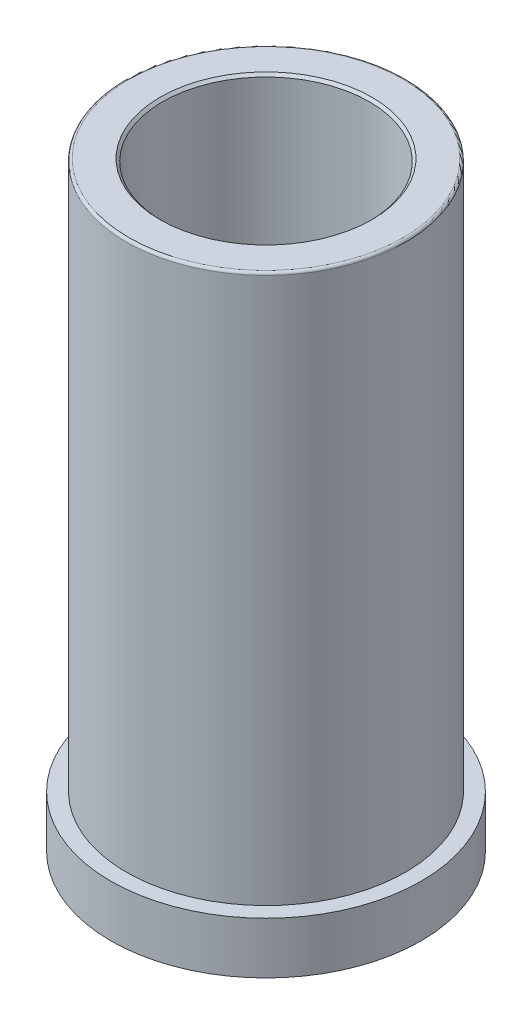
ISO-10303-21;
HEADER;
FILE_DESCRIPTION(('STEP AP214'),'2;1');
FILE_NAME('part.step','',(''),(''),'','','');
FILE_SCHEMA(('AUTOMOTIVE_DESIGN { 1 0 10303 214 1 1 1 1 }'));
ENDSEC;
DATA;
#1=APPLICATION_CONTEXT('core data for automotive mechanical design processes');
#2=APPLICATION_PROTOCOL_DEFINITION('international standard','automotive_design',2000,#1);
#3=PRODUCT_CONTEXT('',#1,'mechanical');
#4=PRODUCT('Part','Part','',(#3));
#5=PRODUCT_RELATED_PRODUCT_CATEGORY('part','',(#4));
#6=PRODUCT_DEFINITION_FORMATION('','',#4);
#7=PRODUCT_DEFINITION_CONTEXT('part definition',#1,'design');
#8=PRODUCT_DEFINITION('design','',#6,#7);
#9=PRODUCT_DEFINITION_SHAPE('','',#8);
#10=(LENGTH_UNIT() NAMED_UNIT(*) SI_UNIT(.MILLI.,.METRE.));
#11=(NAMED_UNIT(*) PLANE_ANGLE_UNIT() SI_UNIT($,.RADIAN.));
#12=(NAMED_UNIT(*) SI_UNIT($,.STERADIAN.) SOLID_ANGLE_UNIT());
#13=UNCERTAINTY_MEASURE_WITH_UNIT(LENGTH_MEASURE(1.E-05),#10,'distance_accuracy_value','');
#14=(GEOMETRIC_REPRESENTATION_CONTEXT(3) GLOBAL_UNCERTAINTY_ASSIGNED_CONTEXT((#13)) GLOBAL_UNIT_ASSIGNED_CONTEXT((#10,
#11,#12)) REPRESENTATION_CONTEXT('',''));
#15=CARTESIAN_POINT('',(0.,0.,0.));
#16=DIRECTION('',(0.,0.,1.));
#17=DIRECTION('',(1.,0.,0.));
#18=AXIS2_PLACEMENT_3D('',#15,#16,#17);
#19=CARTESIAN_POINT('',(0.,0.,0.));
#20=DIRECTION('',(0.,-1.,0.));
#21=DIRECTION('',(0.,0.,-1.));
#22=AXIS2_PLACEMENT_3D('',#19,#20,#21);
#23=CYLINDRICAL_SURFACE('',#22,27.);
#24=CARTESIAN_POINT('',(0.,105.5,0.));
#25=DIRECTION('',(0.,-1.,0.));
#26=DIRECTION('',(0.,0.,-1.));
#27=AXIS2_PLACEMENT_3D('',#24,#25,#26);
#28=CIRCLE('',#27,27.);
#29=CARTESIAN_POINT('',(0.,105.5,-27.));
#30=VERTEX_POINT('',#29);
#31=EDGE_CURVE('E21',#30,#30,#28,.T.);
#32=ORIENTED_EDGE('',*,*,#31,.T.);
#33=EDGE_LOOP('',(#32));
#34=FACE_BOUND('',#33,.T.);
#35=CARTESIAN_POINT('',(0.,0.,0.));
#36=DIRECTION('',(0.,-1.,0.));
#37=DIRECTION('',(0.,0.,-1.));
#38=AXIS2_PLACEMENT_3D('',#35,#36,#37);
#39=CIRCLE('',#38,27.);
#40=CARTESIAN_POINT('',(0.,0.,-27.));
#41=VERTEX_POINT('',#40);
#42=EDGE_CURVE('E49',#41,#41,#39,.T.);
#43=ORIENTED_EDGE('',*,*,#42,.F.);
#44=EDGE_LOOP('',(#43));
#45=FACE_BOUND('',#44,.T.);
#46=ADVANCED_FACE('F14',(#34,#45),#23,.T.);
#47=CARTESIAN_POINT('',(-27.,106.,0.));
#48=DIRECTION('',(0.,-1.,0.));
#49=DIRECTION('',(0.,0.,-1.));
#50=AXIS2_PLACEMENT_3D('',#47,#48,#49);
#51=PLANE('',#50);
#52=CARTESIAN_POINT('',(0.,106.,0.));
#53=DIRECTION('',(0.,-1.,0.));
#54=DIRECTION('',(0.,0.,-1.));
#55=AXIS2_PLACEMENT_3D('',#52,#53,#54);
#56=CIRCLE('',#55,26.5);
#57=CARTESIAN_POINT('',(0.,106.,-26.5));
#58=VERTEX_POINT('',#57);
#59=EDGE_CURVE('E9',#58,#58,#56,.F.);
#60=ORIENTED_EDGE('',*,*,#59,.T.);
#61=EDGE_LOOP('',(#60));
#62=FACE_BOUND('',#61,.T.);
#63=CARTESIAN_POINT('',(0.,106.,0.));
#64=DIRECTION('',(0.,-1.,0.));
#65=DIRECTION('',(0.,0.,-1.));
#66=AXIS2_PLACEMENT_3D('',#63,#64,#65);
#67=CIRCLE('',#66,20.5);
#68=CARTESIAN_POINT('',(0.,106.,-20.5));
#69=VERTEX_POINT('',#68);
#70=EDGE_CURVE('E37',#69,#69,#67,.T.);
#71=ORIENTED_EDGE('',*,*,#70,.T.);
#72=EDGE_LOOP('',(#71));
#73=FACE_BOUND('',#72,.T.);
#74=ADVANCED_FACE('F56',(#62,#73),#51,.F.);
#75=CARTESIAN_POINT('',(0.,0.,0.));
#76=DIRECTION('',(0.,-1.,0.));
#77=DIRECTION('',(0.,0.,-1.));
#78=AXIS2_PLACEMENT_3D('',#75,#76,#77);
#79=CYLINDRICAL_SURFACE('',#78,20.);
#80=CARTESIAN_POINT('',(0.,105.5,0.));
#81=DIRECTION('',(0.,-1.,0.));
#82=DIRECTION('',(0.,0.,-1.));
#83=AXIS2_PLACEMENT_3D('',#80,#81,#82);
#84=CIRCLE('',#83,20.);
#85=CARTESIAN_POINT('',(0.,105.5,-20.));
#86=VERTEX_POINT('',#85);
#87=EDGE_CURVE('E34',#86,#86,#84,.F.);
#88=ORIENTED_EDGE('',*,*,#87,.T.);
#89=EDGE_LOOP('',(#88));
#90=FACE_BOUND('',#89,.T.);
#91=CARTESIAN_POINT('',(0.,-10.,0.));
#92=DIRECTION('',(0.,-1.,0.));
#93=DIRECTION('',(0.,0.,-1.));
#94=AXIS2_PLACEMENT_3D('',#91,#92,#93);
#95=CIRCLE('',#94,20.);
#96=CARTESIAN_POINT('',(0.,-10.,-20.));
#97=VERTEX_POINT('',#96);
#98=EDGE_CURVE('E40',#97,#97,#95,.T.);
#99=ORIENTED_EDGE('',*,*,#98,.T.);
#100=EDGE_LOOP('',(#99));
#101=FACE_BOUND('',#100,.T.);
#102=ADVANCED_FACE('F63',(#90,#101),#79,.F.);
#103=CARTESIAN_POINT('',(0.,-10.15,0.));
#104=DIRECTION('',(0.,-1.,0.));
#105=DIRECTION('',(0.,0.,-1.));
#106=AXIS2_PLACEMENT_3D('',#103,#104,#105);
#107=CONICAL_SURFACE('',#106,20.1,0.588002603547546);
#108=CARTESIAN_POINT('',(0.,-10.36,0.));
#109=DIRECTION('',(0.,1.,0.));
#110=DIRECTION('',(0.,0.,1.));
#111=AXIS2_PLACEMENT_3D('',#108,#109,#110);
#112=CIRCLE('',#111,20.24);
#113=CARTESIAN_POINT('',(0.,-10.36,20.24));
#114=VERTEX_POINT('',#113);
#115=EDGE_CURVE('E25',#114,#114,#112,.F.);
#116=ORIENTED_EDGE('',*,*,#115,.T.);
#117=EDGE_LOOP('',(#116));
#118=FACE_BOUND('',#117,.T.);
#119=ORIENTED_EDGE('',*,*,#98,.F.);
#120=EDGE_LOOP('',(#119));
#121=FACE_BOUND('',#120,.T.);
#122=ADVANCED_FACE('F82',(#118,#121),#107,.F.);
#123=CARTESIAN_POINT('',(-20.1,-10.,0.));
#124=DIRECTION('',(0.,1.,0.));
#125=DIRECTION('',(0.,0.,1.));
#126=AXIS2_PLACEMENT_3D('',#123,#124,#125);
#127=PLANE('',#126);
#128=CARTESIAN_POINT('',(0.,-10.,0.));
#129=DIRECTION('',(0.,1.,0.));
#130=DIRECTION('',(0.,0.,1.));
#131=AXIS2_PLACEMENT_3D('',#128,#129,#130);
#132=CIRCLE('',#131,20.6);
#133=CARTESIAN_POINT('',(0.,-10.,20.6));
#134=VERTEX_POINT('',#133);
#135=EDGE_CURVE('E29',#134,#134,#132,.T.);
#136=ORIENTED_EDGE('',*,*,#135,.T.);
#137=EDGE_LOOP('',(#136));
#138=FACE_BOUND('',#137,.T.);
#139=CARTESIAN_POINT('',(0.,-10.,0.));
#140=DIRECTION('',(0.,-1.,0.));
#141=DIRECTION('',(0.,0.,-1.));
#142=AXIS2_PLACEMENT_3D('',#139,#140,#141);
#143=CIRCLE('',#142,30.);
#144=CARTESIAN_POINT('',(0.,-10.,-30.));
#145=VERTEX_POINT('',#144);
#146=EDGE_CURVE('E43',#145,#145,#143,.T.);
#147=ORIENTED_EDGE('',*,*,#146,.T.);
#148=EDGE_LOOP('',(#147));
#149=FACE_BOUND('',#148,.T.);
#150=ADVANCED_FACE('F85',(#138,#149),#127,.F.);
#151=CARTESIAN_POINT('',(0.,0.,0.));
#152=DIRECTION('',(0.,-1.,0.));
#153=DIRECTION('',(0.,0.,-1.));
#154=AXIS2_PLACEMENT_3D('',#151,#152,#153);
#155=CYLINDRICAL_SURFACE('',#154,30.);
#156=ORIENTED_EDGE('',*,*,#146,.F.);
#157=EDGE_LOOP('',(#156));
#158=FACE_BOUND('',#157,.T.);
#159=CARTESIAN_POINT('',(0.,0.,0.));
#160=DIRECTION('',(0.,-1.,0.));
#161=DIRECTION('',(0.,0.,-1.));
#162=AXIS2_PLACEMENT_3D('',#159,#160,#161);
#163=CIRCLE('',#162,30.);
#164=CARTESIAN_POINT('',(0.,0.,-30.));
#165=VERTEX_POINT('',#164);
#166=EDGE_CURVE('E46',#165,#165,#163,.T.);
#167=ORIENTED_EDGE('',*,*,#166,.T.);
#168=EDGE_LOOP('',(#167));
#169=FACE_BOUND('',#168,.T.);
#170=ADVANCED_FACE('F97',(#158,#169),#155,.T.);
#171=CARTESIAN_POINT('',(-30.,0.,0.));
#172=DIRECTION('',(0.,-1.,0.));
#173=DIRECTION('',(0.,0.,-1.));
#174=AXIS2_PLACEMENT_3D('',#171,#172,#173);
#175=PLANE('',#174);
#176=ORIENTED_EDGE('',*,*,#166,.F.);
#177=EDGE_LOOP('',(#176));
#178=FACE_BOUND('',#177,.T.);
#179=ORIENTED_EDGE('',*,*,#42,.T.);
#180=EDGE_LOOP('',(#179));
#181=FACE_BOUND('',#180,.T.);
#182=ADVANCED_FACE('F53',(#178,#181),#175,.F.);
#183=CARTESIAN_POINT('',(0.,106.,0.));
#184=DIRECTION('',(0.,1.,0.));
#185=DIRECTION('',(0.,0.,1.));
#186=AXIS2_PLACEMENT_3D('',#183,#184,#185);
#187=CONICAL_SURFACE('',#186,20.5,0.785398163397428);
#188=ORIENTED_EDGE('',*,*,#87,.F.);
#189=EDGE_LOOP('',(#188));
#190=FACE_BOUND('',#189,.T.);
#191=ORIENTED_EDGE('',*,*,#70,.F.);
#192=EDGE_LOOP('',(#191));
#193=FACE_BOUND('',#192,.T.);
#194=ADVANCED_FACE('F67',(#190,#193),#187,.F.);
#195=CARTESIAN_POINT('',(0.,-10.5,0.));
#196=DIRECTION('',(0.,1.,0.));
#197=DIRECTION('',(0.,0.,1.));
#198=AXIS2_PLACEMENT_3D('',#195,#196,#197);
#199=CONICAL_SURFACE('',#198,20.1,0.785398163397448);
#200=ORIENTED_EDGE('',*,*,#135,.F.);
#201=EDGE_LOOP('',(#200));
#202=FACE_BOUND('',#201,.T.);
#203=ORIENTED_EDGE('',*,*,#115,.F.);
#204=EDGE_LOOP('',(#203));
#205=FACE_BOUND('',#204,.T.);
#206=ADVANCED_FACE('F69',(#202,#205),#199,.T.);
#207=CARTESIAN_POINT('',(0.,105.5,0.));
#208=DIRECTION('',(0.,-1.,0.));
#209=DIRECTION('',(0.,0.,-1.));
#210=AXIS2_PLACEMENT_3D('',#207,#208,#209);
#211=TOROIDAL_SURFACE('',#210,26.5,0.5);
#212=ORIENTED_EDGE('',*,*,#59,.F.);
#213=EDGE_LOOP('',(#212));
#214=FACE_BOUND('',#213,.T.);
#215=ORIENTED_EDGE('',*,*,#31,.F.);
#216=EDGE_LOOP('',(#215));
#217=FACE_BOUND('',#216,.T.);
#218=ADVANCED_FACE('F16',(#214,#217),#211,.T.);
#219=CLOSED_SHELL('',(#46,#74,#102,#122,#150,#170,#182,#194,#206,#218));
#220=MANIFOLD_SOLID_BREP('B1',#219);
#221=ADVANCED_BREP_SHAPE_REPRESENTATION('',(#18,#220),#14);
#222=SHAPE_DEFINITION_REPRESENTATION(#9,#221);
ENDSEC;
END-ISO-10303-21;
